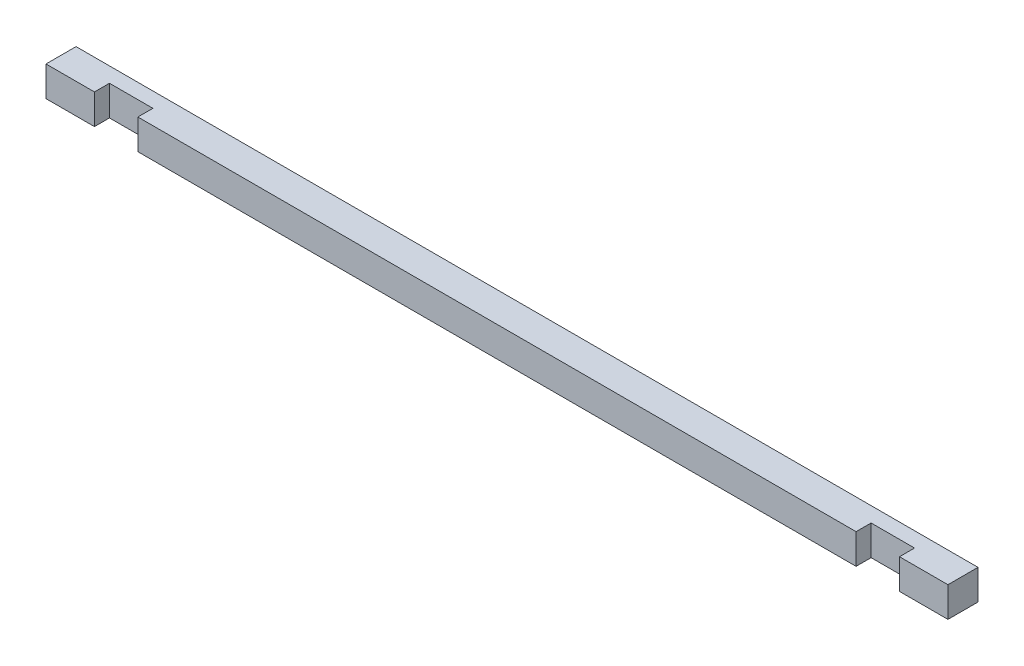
ISO-10303-21;
HEADER;
FILE_DESCRIPTION(('STEP AP214'),'2;1');
FILE_NAME('part.step','',(''),(''),'','','');
FILE_SCHEMA(('AUTOMOTIVE_DESIGN { 1 0 10303 214 1 1 1 1 }'));
ENDSEC;
DATA;
#1=APPLICATION_CONTEXT('core data for automotive mechanical design processes');
#2=APPLICATION_PROTOCOL_DEFINITION('international standard','automotive_design',2000,#1);
#3=PRODUCT_CONTEXT('',#1,'mechanical');
#4=PRODUCT('Part','Part','',(#3));
#5=PRODUCT_RELATED_PRODUCT_CATEGORY('part','',(#4));
#6=PRODUCT_DEFINITION_FORMATION('','',#4);
#7=PRODUCT_DEFINITION_CONTEXT('part definition',#1,'design');
#8=PRODUCT_DEFINITION('design','',#6,#7);
#9=PRODUCT_DEFINITION_SHAPE('','',#8);
#10=(LENGTH_UNIT() NAMED_UNIT(*) SI_UNIT(.MILLI.,.METRE.));
#11=(NAMED_UNIT(*) PLANE_ANGLE_UNIT() SI_UNIT($,.RADIAN.));
#12=(NAMED_UNIT(*) SI_UNIT($,.STERADIAN.) SOLID_ANGLE_UNIT());
#13=UNCERTAINTY_MEASURE_WITH_UNIT(LENGTH_MEASURE(1.E-05),#10,'distance_accuracy_value','');
#14=(GEOMETRIC_REPRESENTATION_CONTEXT(3) GLOBAL_UNCERTAINTY_ASSIGNED_CONTEXT((#13)) GLOBAL_UNIT_ASSIGNED_CONTEXT((#10,
#11,#12)) REPRESENTATION_CONTEXT('',''));
#15=CARTESIAN_POINT('',(0.,0.,0.));
#16=DIRECTION('',(0.,0.,1.));
#17=DIRECTION('',(1.,0.,0.));
#18=AXIS2_PLACEMENT_3D('',#15,#16,#17);
#19=CARTESIAN_POINT('',(0.,9.,9.));
#20=DIRECTION('',(0.,0.,-1.));
#21=DIRECTION('',(-1.,0.,0.));
#22=AXIS2_PLACEMENT_3D('',#19,#20,#21);
#23=PLANE('',#22);
#24=DIRECTION('',(1.,0.,0.));
#25=VECTOR('',#24,1.);
#26=CARTESIAN_POINT('',(0.,0.,9.));
#27=LINE('',#26,#25);
#28=CARTESIAN_POINT('',(27.5,0.,9.));
#29=VERTEX_POINT('',#28);
#30=CARTESIAN_POINT('',(242.5,0.,9.));
#31=VERTEX_POINT('',#30);
#32=EDGE_CURVE('E192',#29,#31,#27,.T.);
#33=ORIENTED_EDGE('',*,*,#32,.T.);
#34=DIRECTION('',(0.,-1.,0.));
#35=VECTOR('',#34,1.);
#36=CARTESIAN_POINT('',(242.5,0.,9.));
#37=LINE('',#36,#35);
#38=CARTESIAN_POINT('',(242.5,9.,9.));
#39=VERTEX_POINT('',#38);
#40=EDGE_CURVE('E126',#39,#31,#37,.T.);
#41=ORIENTED_EDGE('',*,*,#40,.F.);
#42=DIRECTION('',(-1.,0.,0.));
#43=VECTOR('',#42,1.);
#44=CARTESIAN_POINT('',(0.,9.,9.));
#45=LINE('',#44,#43);
#46=CARTESIAN_POINT('',(27.5,9.,9.));
#47=VERTEX_POINT('',#46);
#48=EDGE_CURVE('E199',#39,#47,#45,.T.);
#49=ORIENTED_EDGE('',*,*,#48,.T.);
#50=DIRECTION('',(0.,1.,0.));
#51=VECTOR('',#50,1.);
#52=CARTESIAN_POINT('',(27.5,0.,9.));
#53=LINE('',#52,#51);
#54=EDGE_CURVE('E162',#29,#47,#53,.T.);
#55=ORIENTED_EDGE('',*,*,#54,.F.);
#56=EDGE_LOOP('',(#33,#41,#49,#55));
#57=FACE_BOUND('',#56,.T.);
#58=ADVANCED_FACE('F31',(#57),#23,.F.);
#59=CARTESIAN_POINT('',(0.,0.,9.));
#60=VERTEX_POINT('',#59);
#61=CARTESIAN_POINT('',(14.5,0.,9.));
#62=VERTEX_POINT('',#61);
#63=EDGE_CURVE('E188',#60,#62,#27,.T.);
#64=ORIENTED_EDGE('',*,*,#63,.T.);
#65=DIRECTION('',(0.,-1.,0.));
#66=VECTOR('',#65,1.);
#67=CARTESIAN_POINT('',(14.5,0.,9.));
#68=LINE('',#67,#66);
#69=CARTESIAN_POINT('',(14.5,9.,9.));
#70=VERTEX_POINT('',#69);
#71=EDGE_CURVE('E153',#70,#62,#68,.T.);
#72=ORIENTED_EDGE('',*,*,#71,.F.);
#73=CARTESIAN_POINT('',(0.,9.,9.));
#74=VERTEX_POINT('',#73);
#75=EDGE_CURVE('E194',#70,#74,#45,.T.);
#76=ORIENTED_EDGE('',*,*,#75,.T.);
#77=DIRECTION('',(0.,-1.,0.));
#78=VECTOR('',#77,1.);
#79=CARTESIAN_POINT('',(0.,0.,9.));
#80=LINE('',#79,#78);
#81=EDGE_CURVE('E183',#74,#60,#80,.T.);
#82=ORIENTED_EDGE('',*,*,#81,.T.);
#83=EDGE_LOOP('',(#64,#72,#76,#82));
#84=FACE_BOUND('',#83,.T.);
#85=ADVANCED_FACE('F232',(#84),#23,.F.);
#86=CARTESIAN_POINT('',(0.,0.,9.));
#87=DIRECTION('',(1.,0.,0.));
#88=DIRECTION('',(0.,0.,-1.));
#89=AXIS2_PLACEMENT_3D('',#86,#87,#88);
#90=PLANE('',#89);
#91=DIRECTION('',(0.,-1.,0.));
#92=VECTOR('',#91,1.);
#93=CARTESIAN_POINT('',(0.,0.,0.));
#94=LINE('',#93,#92);
#95=CARTESIAN_POINT('',(0.,9.,0.));
#96=VERTEX_POINT('',#95);
#97=CARTESIAN_POINT('',(0.,0.,0.));
#98=VERTEX_POINT('',#97);
#99=EDGE_CURVE('E176',#96,#98,#94,.T.);
#100=ORIENTED_EDGE('',*,*,#99,.T.);
#101=DIRECTION('',(0.,0.,-1.));
#102=VECTOR('',#101,1.);
#103=CARTESIAN_POINT('',(0.,0.,9.));
#104=LINE('',#103,#102);
#105=EDGE_CURVE('E11',#60,#98,#104,.T.);
#106=ORIENTED_EDGE('',*,*,#105,.F.);
#107=ORIENTED_EDGE('',*,*,#81,.F.);
#108=DIRECTION('',(0.,0.,-1.));
#109=VECTOR('',#108,1.);
#110=CARTESIAN_POINT('',(0.,9.,9.));
#111=LINE('',#110,#109);
#112=EDGE_CURVE('E198',#74,#96,#111,.T.);
#113=ORIENTED_EDGE('',*,*,#112,.T.);
#114=EDGE_LOOP('',(#100,#106,#107,#113));
#115=FACE_BOUND('',#114,.T.);
#116=ADVANCED_FACE('F33',(#115),#90,.F.);
#117=CARTESIAN_POINT('',(0.,0.,9.));
#118=DIRECTION('',(0.,1.,0.));
#119=DIRECTION('',(0.,0.,1.));
#120=AXIS2_PLACEMENT_3D('',#117,#118,#119);
#121=PLANE('',#120);
#122=DIRECTION('',(1.,0.,0.));
#123=VECTOR('',#122,1.);
#124=CARTESIAN_POINT('',(242.5,0.,4.5));
#125=LINE('',#124,#123);
#126=CARTESIAN_POINT('',(242.5,0.,4.5));
#127=VERTEX_POINT('',#126);
#128=CARTESIAN_POINT('',(255.5,0.,4.5));
#129=VERTEX_POINT('',#128);
#130=EDGE_CURVE('E137',#127,#129,#125,.T.);
#131=ORIENTED_EDGE('',*,*,#130,.F.);
#132=DIRECTION('',(0.,0.,1.));
#133=VECTOR('',#132,1.);
#134=CARTESIAN_POINT('',(242.5,0.,4.5));
#135=LINE('',#134,#133);
#136=EDGE_CURVE('E120',#127,#31,#135,.T.);
#137=ORIENTED_EDGE('',*,*,#136,.T.);
#138=ORIENTED_EDGE('',*,*,#32,.F.);
#139=DIRECTION('',(0.,0.,1.));
#140=VECTOR('',#139,1.);
#141=CARTESIAN_POINT('',(27.5,0.,4.5));
#142=LINE('',#141,#140);
#143=CARTESIAN_POINT('',(27.5,0.,4.5));
#144=VERTEX_POINT('',#143);
#145=EDGE_CURVE('E54',#144,#29,#142,.T.);
#146=ORIENTED_EDGE('',*,*,#145,.F.);
#147=DIRECTION('',(1.,0.,0.));
#148=VECTOR('',#147,1.);
#149=CARTESIAN_POINT('',(14.5,0.,4.5));
#150=LINE('',#149,#148);
#151=CARTESIAN_POINT('',(14.5,0.,4.5));
#152=VERTEX_POINT('',#151);
#153=EDGE_CURVE('E161',#152,#144,#150,.T.);
#154=ORIENTED_EDGE('',*,*,#153,.F.);
#155=DIRECTION('',(0.,0.,1.));
#156=VECTOR('',#155,1.);
#157=CARTESIAN_POINT('',(14.5,0.,4.5));
#158=LINE('',#157,#156);
#159=EDGE_CURVE('E171',#152,#62,#158,.T.);
#160=ORIENTED_EDGE('',*,*,#159,.T.);
#161=ORIENTED_EDGE('',*,*,#63,.F.);
#162=ORIENTED_EDGE('',*,*,#105,.T.);
#163=DIRECTION('',(1.,0.,0.));
#164=VECTOR('',#163,1.);
#165=CARTESIAN_POINT('',(0.,0.,0.));
#166=LINE('',#165,#164);
#167=CARTESIAN_POINT('',(270.,0.,0.));
#168=VERTEX_POINT('',#167);
#169=EDGE_CURVE('E202',#98,#168,#166,.T.);
#170=ORIENTED_EDGE('',*,*,#169,.T.);
#171=DIRECTION('',(0.,0.,-1.));
#172=VECTOR('',#171,1.);
#173=CARTESIAN_POINT('',(270.,0.,9.));
#174=LINE('',#173,#172);
#175=CARTESIAN_POINT('',(270.,0.,9.));
#176=VERTEX_POINT('',#175);
#177=EDGE_CURVE('E39',#176,#168,#174,.T.);
#178=ORIENTED_EDGE('',*,*,#177,.F.);
#179=CARTESIAN_POINT('',(255.5,0.,9.));
#180=VERTEX_POINT('',#179);
#181=EDGE_CURVE('E186',#180,#176,#27,.T.);
#182=ORIENTED_EDGE('',*,*,#181,.F.);
#183=DIRECTION('',(0.,0.,1.));
#184=VECTOR('',#183,1.);
#185=CARTESIAN_POINT('',(255.5,0.,4.5));
#186=LINE('',#185,#184);
#187=EDGE_CURVE('E46',#129,#180,#186,.T.);
#188=ORIENTED_EDGE('',*,*,#187,.F.);
#189=EDGE_LOOP('',(#131,#137,#138,#146,#154,#160,#161,#162,#170,#178,#182,#188));
#190=FACE_BOUND('',#189,.T.);
#191=ADVANCED_FACE('F142',(#190),#121,.F.);
#192=CARTESIAN_POINT('',(270.,0.,9.));
#193=DIRECTION('',(-1.,0.,0.));
#194=DIRECTION('',(0.,0.,1.));
#195=AXIS2_PLACEMENT_3D('',#192,#193,#194);
#196=PLANE('',#195);
#197=DIRECTION('',(0.,1.,0.));
#198=VECTOR('',#197,1.);
#199=CARTESIAN_POINT('',(270.,0.,0.));
#200=LINE('',#199,#198);
#201=CARTESIAN_POINT('',(270.,9.,0.));
#202=VERTEX_POINT('',#201);
#203=EDGE_CURVE('E204',#168,#202,#200,.T.);
#204=ORIENTED_EDGE('',*,*,#203,.T.);
#205=DIRECTION('',(0.,0.,-1.));
#206=VECTOR('',#205,1.);
#207=CARTESIAN_POINT('',(270.,9.,9.));
#208=LINE('',#207,#206);
#209=CARTESIAN_POINT('',(270.,9.,9.));
#210=VERTEX_POINT('',#209);
#211=EDGE_CURVE('E209',#210,#202,#208,.T.);
#212=ORIENTED_EDGE('',*,*,#211,.F.);
#213=DIRECTION('',(0.,1.,0.));
#214=VECTOR('',#213,1.);
#215=CARTESIAN_POINT('',(270.,0.,9.));
#216=LINE('',#215,#214);
#217=EDGE_CURVE('E191',#176,#210,#216,.T.);
#218=ORIENTED_EDGE('',*,*,#217,.F.);
#219=ORIENTED_EDGE('',*,*,#177,.T.);
#220=EDGE_LOOP('',(#204,#212,#218,#219));
#221=FACE_BOUND('',#220,.T.);
#222=ADVANCED_FACE('F216',(#221),#196,.F.);
#223=CARTESIAN_POINT('',(0.,9.,9.));
#224=DIRECTION('',(0.,-1.,0.));
#225=DIRECTION('',(0.,0.,-1.));
#226=AXIS2_PLACEMENT_3D('',#223,#224,#225);
#227=PLANE('',#226);
#228=ORIENTED_EDGE('',*,*,#48,.F.);
#229=DIRECTION('',(0.,0.,1.));
#230=VECTOR('',#229,1.);
#231=CARTESIAN_POINT('',(242.5,9.,4.5));
#232=LINE('',#231,#230);
#233=CARTESIAN_POINT('',(242.5,9.,4.5));
#234=VERTEX_POINT('',#233);
#235=EDGE_CURVE('E151',#234,#39,#232,.T.);
#236=ORIENTED_EDGE('',*,*,#235,.F.);
#237=DIRECTION('',(-1.,0.,0.));
#238=VECTOR('',#237,1.);
#239=CARTESIAN_POINT('',(242.5,9.,4.5));
#240=LINE('',#239,#238);
#241=CARTESIAN_POINT('',(255.5,9.,4.5));
#242=VERTEX_POINT('',#241);
#243=EDGE_CURVE('E131',#242,#234,#240,.T.);
#244=ORIENTED_EDGE('',*,*,#243,.F.);
#245=DIRECTION('',(0.,0.,1.));
#246=VECTOR('',#245,1.);
#247=CARTESIAN_POINT('',(255.5,9.,4.5));
#248=LINE('',#247,#246);
#249=CARTESIAN_POINT('',(255.5,9.,9.));
#250=VERTEX_POINT('',#249);
#251=EDGE_CURVE('E154',#242,#250,#248,.T.);
#252=ORIENTED_EDGE('',*,*,#251,.T.);
#253=EDGE_CURVE('E195',#210,#250,#45,.T.);
#254=ORIENTED_EDGE('',*,*,#253,.F.);
#255=ORIENTED_EDGE('',*,*,#211,.T.);
#256=DIRECTION('',(-1.,0.,0.));
#257=VECTOR('',#256,1.);
#258=CARTESIAN_POINT('',(0.,9.,0.));
#259=LINE('',#258,#257);
#260=EDGE_CURVE('E187',#202,#96,#259,.T.);
#261=ORIENTED_EDGE('',*,*,#260,.T.);
#262=ORIENTED_EDGE('',*,*,#112,.F.);
#263=ORIENTED_EDGE('',*,*,#75,.F.);
#264=DIRECTION('',(0.,0.,1.));
#265=VECTOR('',#264,1.);
#266=CARTESIAN_POINT('',(14.5,9.,4.5));
#267=LINE('',#266,#265);
#268=CARTESIAN_POINT('',(14.5,9.,4.5));
#269=VERTEX_POINT('',#268);
#270=EDGE_CURVE('E174',#269,#70,#267,.T.);
#271=ORIENTED_EDGE('',*,*,#270,.F.);
#272=DIRECTION('',(-1.,0.,0.));
#273=VECTOR('',#272,1.);
#274=CARTESIAN_POINT('',(14.5,9.,4.5));
#275=LINE('',#274,#273);
#276=CARTESIAN_POINT('',(27.5,9.,4.5));
#277=VERTEX_POINT('',#276);
#278=EDGE_CURVE('E168',#277,#269,#275,.T.);
#279=ORIENTED_EDGE('',*,*,#278,.F.);
#280=DIRECTION('',(0.,0.,1.));
#281=VECTOR('',#280,1.);
#282=CARTESIAN_POINT('',(27.5,9.,4.5));
#283=LINE('',#282,#281);
#284=EDGE_CURVE('E177',#277,#47,#283,.T.);
#285=ORIENTED_EDGE('',*,*,#284,.T.);
#286=EDGE_LOOP('',(#228,#236,#244,#252,#254,#255,#261,#262,#263,#271,#279,#285));
#287=FACE_BOUND('',#286,.T.);
#288=ADVANCED_FACE('F225',(#287),#227,.F.);
#289=ORIENTED_EDGE('',*,*,#253,.T.);
#290=DIRECTION('',(0.,1.,0.));
#291=VECTOR('',#290,1.);
#292=CARTESIAN_POINT('',(255.5,0.,9.));
#293=LINE('',#292,#291);
#294=EDGE_CURVE('E140',#180,#250,#293,.T.);
#295=ORIENTED_EDGE('',*,*,#294,.F.);
#296=ORIENTED_EDGE('',*,*,#181,.T.);
#297=ORIENTED_EDGE('',*,*,#217,.T.);
#298=EDGE_LOOP('',(#289,#295,#296,#297));
#299=FACE_BOUND('',#298,.T.);
#300=ADVANCED_FACE('F242',(#299),#23,.F.);
#301=CARTESIAN_POINT('',(0.,9.,0.));
#302=DIRECTION('',(0.,0.,-1.));
#303=DIRECTION('',(-1.,0.,0.));
#304=AXIS2_PLACEMENT_3D('',#301,#302,#303);
#305=PLANE('',#304);
#306=ORIENTED_EDGE('',*,*,#99,.F.);
#307=ORIENTED_EDGE('',*,*,#260,.F.);
#308=ORIENTED_EDGE('',*,*,#203,.F.);
#309=ORIENTED_EDGE('',*,*,#169,.F.);
#310=EDGE_LOOP('',(#306,#307,#308,#309));
#311=FACE_BOUND('',#310,.T.);
#312=ADVANCED_FACE('F221',(#311),#305,.T.);
#313=CARTESIAN_POINT('',(14.5,0.,4.5));
#314=DIRECTION('',(-1.,0.,0.));
#315=DIRECTION('',(0.,0.,1.));
#316=AXIS2_PLACEMENT_3D('',#313,#314,#315);
#317=PLANE('',#316);
#318=ORIENTED_EDGE('',*,*,#71,.T.);
#319=ORIENTED_EDGE('',*,*,#159,.F.);
#320=DIRECTION('',(0.,-1.,0.));
#321=VECTOR('',#320,1.);
#322=CARTESIAN_POINT('',(14.5,0.,4.5));
#323=LINE('',#322,#321);
#324=EDGE_CURVE('E158',#269,#152,#323,.T.);
#325=ORIENTED_EDGE('',*,*,#324,.F.);
#326=ORIENTED_EDGE('',*,*,#270,.T.);
#327=EDGE_LOOP('',(#318,#319,#325,#326));
#328=FACE_BOUND('',#327,.T.);
#329=ADVANCED_FACE('F264',(#328),#317,.F.);
#330=CARTESIAN_POINT('',(27.5,0.,4.5));
#331=DIRECTION('',(1.,0.,0.));
#332=DIRECTION('',(0.,0.,-1.));
#333=AXIS2_PLACEMENT_3D('',#330,#331,#332);
#334=PLANE('',#333);
#335=ORIENTED_EDGE('',*,*,#54,.T.);
#336=ORIENTED_EDGE('',*,*,#284,.F.);
#337=DIRECTION('',(0.,1.,0.));
#338=VECTOR('',#337,1.);
#339=CARTESIAN_POINT('',(27.5,0.,4.5));
#340=LINE('',#339,#338);
#341=EDGE_CURVE('E165',#144,#277,#340,.T.);
#342=ORIENTED_EDGE('',*,*,#341,.F.);
#343=ORIENTED_EDGE('',*,*,#145,.T.);
#344=EDGE_LOOP('',(#335,#336,#342,#343));
#345=FACE_BOUND('',#344,.T.);
#346=ADVANCED_FACE('F236',(#345),#334,.F.);
#347=CARTESIAN_POINT('',(14.5,9.,4.5));
#348=DIRECTION('',(0.,0.,-1.));
#349=DIRECTION('',(-1.,0.,0.));
#350=AXIS2_PLACEMENT_3D('',#347,#348,#349);
#351=PLANE('',#350);
#352=ORIENTED_EDGE('',*,*,#324,.T.);
#353=ORIENTED_EDGE('',*,*,#153,.T.);
#354=ORIENTED_EDGE('',*,*,#341,.T.);
#355=ORIENTED_EDGE('',*,*,#278,.T.);
#356=EDGE_LOOP('',(#352,#353,#354,#355));
#357=FACE_BOUND('',#356,.T.);
#358=ADVANCED_FACE('F239',(#357),#351,.F.);
#359=CARTESIAN_POINT('',(242.5,0.,4.5));
#360=DIRECTION('',(-1.,0.,0.));
#361=DIRECTION('',(0.,0.,1.));
#362=AXIS2_PLACEMENT_3D('',#359,#360,#361);
#363=PLANE('',#362);
#364=ORIENTED_EDGE('',*,*,#40,.T.);
#365=ORIENTED_EDGE('',*,*,#136,.F.);
#366=DIRECTION('',(0.,-1.,0.));
#367=VECTOR('',#366,1.);
#368=CARTESIAN_POINT('',(242.5,0.,4.5));
#369=LINE('',#368,#367);
#370=EDGE_CURVE('E123',#234,#127,#369,.T.);
#371=ORIENTED_EDGE('',*,*,#370,.F.);
#372=ORIENTED_EDGE('',*,*,#235,.T.);
#373=EDGE_LOOP('',(#364,#365,#371,#372));
#374=FACE_BOUND('',#373,.T.);
#375=ADVANCED_FACE('F122',(#374),#363,.F.);
#376=CARTESIAN_POINT('',(255.5,0.,4.5));
#377=DIRECTION('',(1.,0.,0.));
#378=DIRECTION('',(0.,0.,-1.));
#379=AXIS2_PLACEMENT_3D('',#376,#377,#378);
#380=PLANE('',#379);
#381=ORIENTED_EDGE('',*,*,#294,.T.);
#382=ORIENTED_EDGE('',*,*,#251,.F.);
#383=DIRECTION('',(0.,1.,0.));
#384=VECTOR('',#383,1.);
#385=CARTESIAN_POINT('',(255.5,0.,4.5));
#386=LINE('',#385,#384);
#387=EDGE_CURVE('E144',#129,#242,#386,.T.);
#388=ORIENTED_EDGE('',*,*,#387,.F.);
#389=ORIENTED_EDGE('',*,*,#187,.T.);
#390=EDGE_LOOP('',(#381,#382,#388,#389));
#391=FACE_BOUND('',#390,.T.);
#392=ADVANCED_FACE('F243',(#391),#380,.F.);
#393=CARTESIAN_POINT('',(242.5,9.,4.5));
#394=DIRECTION('',(0.,0.,-1.));
#395=DIRECTION('',(-1.,0.,0.));
#396=AXIS2_PLACEMENT_3D('',#393,#394,#395);
#397=PLANE('',#396);
#398=ORIENTED_EDGE('',*,*,#370,.T.);
#399=ORIENTED_EDGE('',*,*,#130,.T.);
#400=ORIENTED_EDGE('',*,*,#387,.T.);
#401=ORIENTED_EDGE('',*,*,#243,.T.);
#402=EDGE_LOOP('',(#398,#399,#400,#401));
#403=FACE_BOUND('',#402,.T.);
#404=ADVANCED_FACE('F135',(#403),#397,.F.);
#405=CLOSED_SHELL('',(#58,#85,#116,#191,#222,#288,#300,#312,#329,#346,#358,#375,#392,#404));
#406=MANIFOLD_SOLID_BREP('B2',#405);
#407=ADVANCED_BREP_SHAPE_REPRESENTATION('',(#18,#406),#14);
#408=SHAPE_DEFINITION_REPRESENTATION(#9,#407);
ENDSEC;
END-ISO-10303-21;
